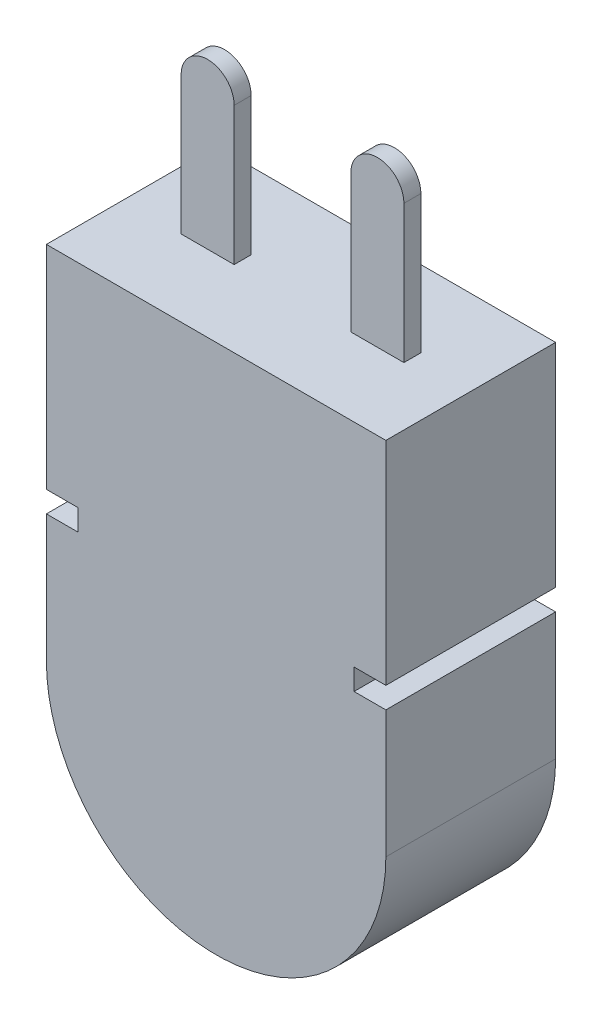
from build123d import *

# Parameters (mm, degrees)
BOSS_EXTRUDE1_DEPTH = 4
BOSS_EXTRUDE2_DEPTH = 0.4


with BuildPart() as part:
    # Sketch2 → Boss-Extrude1 (new, symmetric)
    with BuildSketch(Plane.XY):
        with BuildLine():
            Line((-8, 0), (8, 0))
            Line((8, 0), (8, -10))
            Line((8, -10), (6.5, -10))
            Line((6.5, -10), (6.5, -11))
            Line((6.5, -11), (8, -11))
            Line((8, -11), (8, -17))
            ThreePointArc((8, -17), (0, -25), (-8, -17))
            Line((-8, -17), (-8, -11))
            Line((-8, -11), (-6.5, -11))
            Line((-6.5, -11), (-6.5, -10))
            Line((-6.5, -10), (-8, -10))
            Line((-8, -10), (-8, 0))
        make_face()
    extrude(amount=BOSS_EXTRUDE1_DEPTH, both=True)

    # Sketch3 → Boss-Extrude2 (add, symmetric)
    with BuildSketch(Plane.XY):
        with BuildLine():
            Line((-5.25, 0), (-5.25, 6.5))
            ThreePointArc((-5.25, 6.5), (-4, 7.75), (-2.75, 6.5))
            Line((-2.75, 6.5), (-2.75, 0))
            Line((-2.75, 0), (-5.25, 0))
        make_face()
        with BuildLine():
            Line((5.25, 0), (5.25, 6.5))
            ThreePointArc((5.25, 6.5), (4, 7.75), (2.75, 6.5))
            Line((2.75, 6.5), (2.75, 0))
            Line((2.75, 0), (5.25, 0))
        make_face()
    extrude(amount=BOSS_EXTRUDE2_DEPTH, both=True)


solid = part.part
